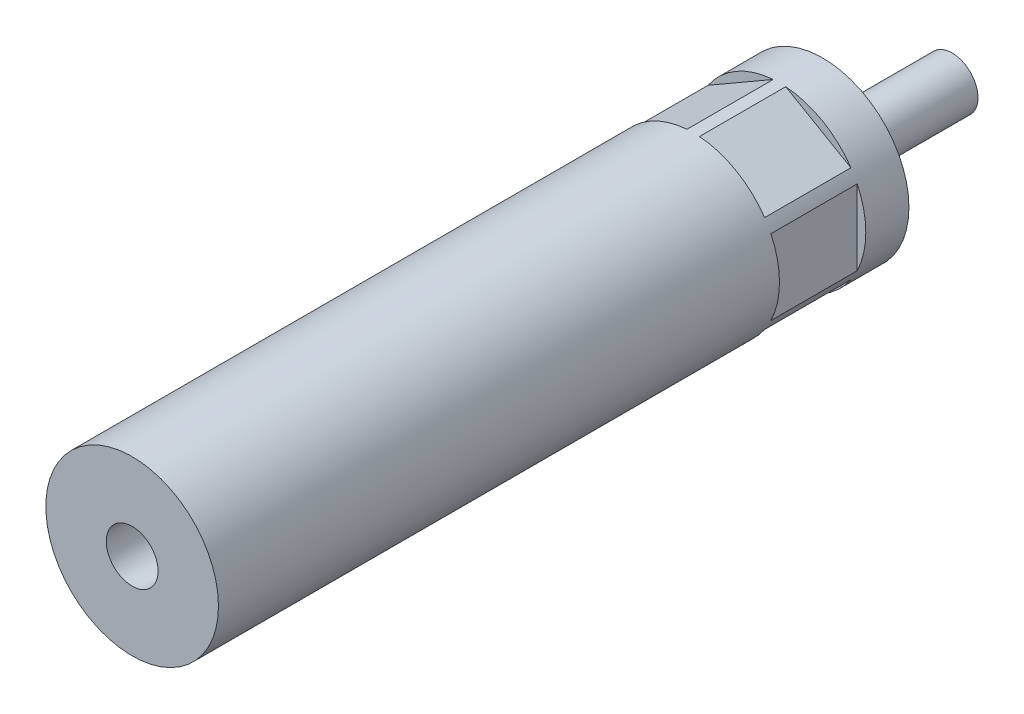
ISO-10303-21;
HEADER;
FILE_DESCRIPTION(('STEP AP214'),'2;1');
FILE_NAME('part.step','',(''),(''),'','','');
FILE_SCHEMA(('AUTOMOTIVE_DESIGN { 1 0 10303 214 1 1 1 1 }'));
ENDSEC;
DATA;
#1=APPLICATION_CONTEXT('core data for automotive mechanical design processes');
#2=APPLICATION_PROTOCOL_DEFINITION('international standard','automotive_design',2000,#1);
#3=PRODUCT_CONTEXT('',#1,'mechanical');
#4=PRODUCT('Part','Part','',(#3));
#5=PRODUCT_RELATED_PRODUCT_CATEGORY('part','',(#4));
#6=PRODUCT_DEFINITION_FORMATION('','',#4);
#7=PRODUCT_DEFINITION_CONTEXT('part definition',#1,'design');
#8=PRODUCT_DEFINITION('design','',#6,#7);
#9=PRODUCT_DEFINITION_SHAPE('','',#8);
#10=(LENGTH_UNIT() NAMED_UNIT(*) SI_UNIT(.MILLI.,.METRE.));
#11=(NAMED_UNIT(*) PLANE_ANGLE_UNIT() SI_UNIT($,.RADIAN.));
#12=(NAMED_UNIT(*) SI_UNIT($,.STERADIAN.) SOLID_ANGLE_UNIT());
#13=UNCERTAINTY_MEASURE_WITH_UNIT(LENGTH_MEASURE(1.E-05),#10,'distance_accuracy_value','');
#14=(GEOMETRIC_REPRESENTATION_CONTEXT(3) GLOBAL_UNCERTAINTY_ASSIGNED_CONTEXT((#13)) GLOBAL_UNIT_ASSIGNED_CONTEXT((#10,
#11,#12)) REPRESENTATION_CONTEXT('',''));
#15=CARTESIAN_POINT('',(0.,0.,0.));
#16=DIRECTION('',(0.,0.,1.));
#17=DIRECTION('',(1.,0.,0.));
#18=AXIS2_PLACEMENT_3D('',#15,#16,#17);
#19=CARTESIAN_POINT('',(0.,0.,80.));
#20=DIRECTION('',(0.,0.,1.));
#21=DIRECTION('',(1.,0.,0.));
#22=AXIS2_PLACEMENT_3D('',#19,#20,#21);
#23=CYLINDRICAL_SURFACE('',#22,20.);
#24=CARTESIAN_POINT('',(0.,0.,10.));
#25=DIRECTION('',(0.,0.,1.));
#26=DIRECTION('',(1.,0.,0.));
#27=AXIS2_PLACEMENT_3D('',#24,#25,#26);
#28=CIRCLE('',#27,20.);
#29=CARTESIAN_POINT('',(-16.5498344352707,-11.2295583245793,10.));
#30=VERTEX_POINT('',#29);
#31=CARTESIAN_POINT('',(-1.45016556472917,-19.9473562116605,10.));
#32=VERTEX_POINT('',#31);
#33=EDGE_CURVE('E152',#30,#32,#28,.T.);
#34=ORIENTED_EDGE('',*,*,#33,.F.);
#35=DIRECTION('',(0.,0.,1.));
#36=VECTOR('',#35,1.);
#37=CARTESIAN_POINT('',(-16.5498344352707,-11.2295583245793,80.));
#38=LINE('',#37,#36);
#39=CARTESIAN_POINT('',(-16.5498344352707,-11.2295583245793,30.));
#40=VERTEX_POINT('',#39);
#41=EDGE_CURVE('E9',#30,#40,#38,.T.);
#42=ORIENTED_EDGE('',*,*,#41,.T.);
#43=CARTESIAN_POINT('',(0.,0.,30.));
#44=DIRECTION('',(0.,0.,1.));
#45=DIRECTION('',(1.,0.,0.));
#46=AXIS2_PLACEMENT_3D('',#43,#44,#45);
#47=CIRCLE('',#46,20.);
#48=CARTESIAN_POINT('',(-1.45016556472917,-19.9473562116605,30.));
#49=VERTEX_POINT('',#48);
#50=EDGE_CURVE('E22',#40,#49,#47,.T.);
#51=ORIENTED_EDGE('',*,*,#50,.T.);
#52=DIRECTION('',(0.,0.,1.));
#53=VECTOR('',#52,1.);
#54=CARTESIAN_POINT('',(-1.45016556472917,-19.9473562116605,80.));
#55=LINE('',#54,#53);
#56=EDGE_CURVE('E149',#49,#32,#55,.F.);
#57=ORIENTED_EDGE('',*,*,#56,.T.);
#58=EDGE_LOOP('',(#34,#42,#51,#57));
#59=FACE_BOUND('',#58,.T.);
#60=DIRECTION('',(0.,0.,1.));
#61=VECTOR('',#60,1.);
#62=CARTESIAN_POINT('',(18.,8.71779788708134,80.));
#63=LINE('',#62,#61);
#64=CARTESIAN_POINT('',(18.,8.71779788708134,10.));
#65=VERTEX_POINT('',#64);
#66=CARTESIAN_POINT('',(18.,8.71779788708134,30.));
#67=VERTEX_POINT('',#66);
#68=EDGE_CURVE('E142',#65,#67,#63,.T.);
#69=ORIENTED_EDGE('',*,*,#68,.F.);
#70=CARTESIAN_POINT('',(18.,-8.71779788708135,10.));
#71=VERTEX_POINT('',#70);
#72=EDGE_CURVE('E141',#71,#65,#28,.T.);
#73=ORIENTED_EDGE('',*,*,#72,.F.);
#74=DIRECTION('',(0.,0.,1.));
#75=VECTOR('',#74,1.);
#76=CARTESIAN_POINT('',(18.,-8.71779788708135,80.));
#77=LINE('',#76,#75);
#78=CARTESIAN_POINT('',(18.,-8.71779788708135,30.));
#79=VERTEX_POINT('',#78);
#80=EDGE_CURVE('E138',#79,#71,#77,.F.);
#81=ORIENTED_EDGE('',*,*,#80,.F.);
#82=EDGE_CURVE('E145',#79,#67,#47,.T.);
#83=ORIENTED_EDGE('',*,*,#82,.T.);
#84=EDGE_LOOP('',(#69,#73,#81,#83));
#85=FACE_BOUND('',#84,.T.);
#86=CARTESIAN_POINT('',(16.5498344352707,11.2295583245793,10.));
#87=VERTEX_POINT('',#86);
#88=CARTESIAN_POINT('',(1.45016556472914,19.9473562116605,10.));
#89=VERTEX_POINT('',#88);
#90=EDGE_CURVE('E134',#87,#89,#28,.T.);
#91=ORIENTED_EDGE('',*,*,#90,.F.);
#92=DIRECTION('',(0.,0.,1.));
#93=VECTOR('',#92,1.);
#94=CARTESIAN_POINT('',(16.5498344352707,11.2295583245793,80.));
#95=LINE('',#94,#93);
#96=CARTESIAN_POINT('',(16.5498344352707,11.2295583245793,30.));
#97=VERTEX_POINT('',#96);
#98=EDGE_CURVE('E135',#87,#97,#95,.T.);
#99=ORIENTED_EDGE('',*,*,#98,.T.);
#100=CARTESIAN_POINT('',(1.45016556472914,19.9473562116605,30.));
#101=VERTEX_POINT('',#100);
#102=EDGE_CURVE('E139',#97,#101,#47,.T.);
#103=ORIENTED_EDGE('',*,*,#102,.T.);
#104=DIRECTION('',(0.,0.,1.));
#105=VECTOR('',#104,1.);
#106=CARTESIAN_POINT('',(1.45016556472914,19.9473562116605,80.));
#107=LINE('',#106,#105);
#108=EDGE_CURVE('E131',#101,#89,#107,.F.);
#109=ORIENTED_EDGE('',*,*,#108,.T.);
#110=EDGE_LOOP('',(#91,#99,#103,#109));
#111=FACE_BOUND('',#110,.T.);
#112=CARTESIAN_POINT('',(0.,0.,0.));
#113=DIRECTION('',(0.,0.,1.));
#114=DIRECTION('',(1.,0.,0.));
#115=AXIS2_PLACEMENT_3D('',#112,#113,#114);
#116=CIRCLE('',#115,20.);
#117=CARTESIAN_POINT('',(20.,0.,0.));
#118=VERTEX_POINT('',#117);
#119=EDGE_CURVE('E204',#118,#118,#116,.T.);
#120=ORIENTED_EDGE('',*,*,#119,.T.);
#121=EDGE_LOOP('',(#120));
#122=FACE_BOUND('',#121,.T.);
#123=CARTESIAN_POINT('',(0.,0.,160.));
#124=DIRECTION('',(0.,0.,1.));
#125=DIRECTION('',(1.,0.,0.));
#126=AXIS2_PLACEMENT_3D('',#123,#124,#125);
#127=CIRCLE('',#126,20.);
#128=CARTESIAN_POINT('',(20.,0.,160.));
#129=VERTEX_POINT('',#128);
#130=EDGE_CURVE('E201',#129,#129,#127,.T.);
#131=ORIENTED_EDGE('',*,*,#130,.F.);
#132=EDGE_LOOP('',(#131));
#133=FACE_BOUND('',#132,.T.);
#134=CARTESIAN_POINT('',(-18.,8.71779788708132,10.));
#135=VERTEX_POINT('',#134);
#136=CARTESIAN_POINT('',(-18.,-8.71779788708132,10.));
#137=VERTEX_POINT('',#136);
#138=EDGE_CURVE('E111',#135,#137,#28,.T.);
#139=ORIENTED_EDGE('',*,*,#138,.F.);
#140=DIRECTION('',(0.,0.,1.));
#141=VECTOR('',#140,1.);
#142=CARTESIAN_POINT('',(-18.,8.71779788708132,80.));
#143=LINE('',#142,#141);
#144=CARTESIAN_POINT('',(-18.,8.71779788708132,30.));
#145=VERTEX_POINT('',#144);
#146=EDGE_CURVE('E110',#135,#145,#143,.T.);
#147=ORIENTED_EDGE('',*,*,#146,.T.);
#148=CARTESIAN_POINT('',(-18.,-8.71779788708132,30.));
#149=VERTEX_POINT('',#148);
#150=EDGE_CURVE('E103',#145,#149,#47,.T.);
#151=ORIENTED_EDGE('',*,*,#150,.T.);
#152=DIRECTION('',(0.,0.,1.));
#153=VECTOR('',#152,1.);
#154=CARTESIAN_POINT('',(-18.,-8.71779788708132,80.));
#155=LINE('',#154,#153);
#156=EDGE_CURVE('E117',#149,#137,#155,.F.);
#157=ORIENTED_EDGE('',*,*,#156,.T.);
#158=EDGE_LOOP('',(#139,#147,#151,#157));
#159=FACE_BOUND('',#158,.T.);
#160=DIRECTION('',(0.,0.,1.));
#161=VECTOR('',#160,1.);
#162=CARTESIAN_POINT('',(-16.5498344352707,11.2295583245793,80.));
#163=LINE('',#162,#161);
#164=CARTESIAN_POINT('',(-16.5498344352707,11.2295583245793,10.));
#165=VERTEX_POINT('',#164);
#166=CARTESIAN_POINT('',(-16.5498344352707,11.2295583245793,30.));
#167=VERTEX_POINT('',#166);
#168=EDGE_CURVE('E129',#165,#167,#163,.T.);
#169=ORIENTED_EDGE('',*,*,#168,.F.);
#170=CARTESIAN_POINT('',(-1.45016556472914,19.9473562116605,10.));
#171=VERTEX_POINT('',#170);
#172=EDGE_CURVE('E125',#171,#165,#28,.T.);
#173=ORIENTED_EDGE('',*,*,#172,.F.);
#174=DIRECTION('',(0.,0.,1.));
#175=VECTOR('',#174,1.);
#176=CARTESIAN_POINT('',(-1.45016556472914,19.9473562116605,80.));
#177=LINE('',#176,#175);
#178=CARTESIAN_POINT('',(-1.45016556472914,19.9473562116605,30.));
#179=VERTEX_POINT('',#178);
#180=EDGE_CURVE('E123',#179,#171,#177,.F.);
#181=ORIENTED_EDGE('',*,*,#180,.F.);
#182=EDGE_CURVE('E113',#179,#167,#47,.T.);
#183=ORIENTED_EDGE('',*,*,#182,.T.);
#184=EDGE_LOOP('',(#169,#173,#181,#183));
#185=FACE_BOUND('',#184,.T.);
#186=DIRECTION('',(0.,0.,1.));
#187=VECTOR('',#186,1.);
#188=CARTESIAN_POINT('',(16.5498344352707,-11.2295583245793,80.));
#189=LINE('',#188,#187);
#190=CARTESIAN_POINT('',(16.5498344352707,-11.2295583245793,10.));
#191=VERTEX_POINT('',#190);
#192=CARTESIAN_POINT('',(16.5498344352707,-11.2295583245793,30.));
#193=VERTEX_POINT('',#192);
#194=EDGE_CURVE('E148',#191,#193,#189,.T.);
#195=ORIENTED_EDGE('',*,*,#194,.F.);
#196=CARTESIAN_POINT('',(1.45016556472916,-19.9473562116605,10.));
#197=VERTEX_POINT('',#196);
#198=EDGE_CURVE('E147',#197,#191,#28,.T.);
#199=ORIENTED_EDGE('',*,*,#198,.F.);
#200=DIRECTION('',(0.,0.,1.));
#201=VECTOR('',#200,1.);
#202=CARTESIAN_POINT('',(1.45016556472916,-19.9473562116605,80.));
#203=LINE('',#202,#201);
#204=CARTESIAN_POINT('',(1.45016556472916,-19.9473562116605,30.));
#205=VERTEX_POINT('',#204);
#206=EDGE_CURVE('E144',#205,#197,#203,.F.);
#207=ORIENTED_EDGE('',*,*,#206,.F.);
#208=EDGE_CURVE('E150',#205,#193,#47,.T.);
#209=ORIENTED_EDGE('',*,*,#208,.T.);
#210=EDGE_LOOP('',(#195,#199,#207,#209));
#211=FACE_BOUND('',#210,.T.);
#212=ADVANCED_FACE('F14',(#59,#85,#111,#122,#133,#159,#185,#211),#23,.T.);
#213=CARTESIAN_POINT('',(0.,0.,-30.));
#214=DIRECTION('',(0.,0.,1.));
#215=DIRECTION('',(1.,0.,0.));
#216=AXIS2_PLACEMENT_3D('',#213,#214,#215);
#217=PLANE('',#216);
#218=CARTESIAN_POINT('',(0.,0.,-30.));
#219=DIRECTION('',(0.,0.,1.));
#220=DIRECTION('',(1.,0.,0.));
#221=AXIS2_PLACEMENT_3D('',#218,#219,#220);
#222=CIRCLE('',#221,6.);
#223=CARTESIAN_POINT('',(6.,0.,-30.));
#224=VERTEX_POINT('',#223);
#225=EDGE_CURVE('E159',#224,#224,#222,.T.);
#226=ORIENTED_EDGE('',*,*,#225,.F.);
#227=EDGE_LOOP('',(#226));
#228=FACE_BOUND('',#227,.T.);
#229=ADVANCED_FACE('F16',(#228),#217,.F.);
#230=CARTESIAN_POINT('',(0.,0.,80.));
#231=DIRECTION('',(0.,0.,1.));
#232=DIRECTION('',(1.,0.,0.));
#233=AXIS2_PLACEMENT_3D('',#230,#231,#232);
#234=CYLINDRICAL_SURFACE('',#233,6.);
#235=CARTESIAN_POINT('',(0.,0.,-3.5));
#236=DIRECTION('',(0.,0.,1.));
#237=DIRECTION('',(1.,0.,0.));
#238=AXIS2_PLACEMENT_3D('',#235,#236,#237);
#239=CIRCLE('',#238,6.);
#240=CARTESIAN_POINT('',(6.,0.,-3.5));
#241=VERTEX_POINT('',#240);
#242=EDGE_CURVE('E213',#241,#241,#239,.T.);
#243=ORIENTED_EDGE('',*,*,#242,.F.);
#244=EDGE_LOOP('',(#243));
#245=FACE_BOUND('',#244,.T.);
#246=ORIENTED_EDGE('',*,*,#225,.T.);
#247=EDGE_LOOP('',(#246));
#248=FACE_BOUND('',#247,.T.);
#249=ADVANCED_FACE('F219',(#245,#248),#234,.T.);
#250=CARTESIAN_POINT('',(4.7,0.,-3.5));
#251=DIRECTION('',(0.,0.,1.));
#252=DIRECTION('',(1.,0.,0.));
#253=AXIS2_PLACEMENT_3D('',#250,#251,#252);
#254=PLANE('',#253);
#255=ORIENTED_EDGE('',*,*,#242,.T.);
#256=EDGE_LOOP('',(#255));
#257=FACE_BOUND('',#256,.T.);
#258=CARTESIAN_POINT('',(0.,0.,-3.5));
#259=DIRECTION('',(0.,0.,1.));
#260=DIRECTION('',(1.,0.,0.));
#261=AXIS2_PLACEMENT_3D('',#258,#259,#260);
#262=CIRCLE('',#261,4.7);
#263=CARTESIAN_POINT('',(4.7,0.,-3.5));
#264=VERTEX_POINT('',#263);
#265=EDGE_CURVE('E210',#264,#264,#262,.T.);
#266=ORIENTED_EDGE('',*,*,#265,.F.);
#267=EDGE_LOOP('',(#266));
#268=FACE_BOUND('',#267,.T.);
#269=ADVANCED_FACE('F228',(#257,#268),#254,.T.);
#270=CARTESIAN_POINT('',(0.,0.,80.));
#271=DIRECTION('',(0.,0.,1.));
#272=DIRECTION('',(1.,0.,0.));
#273=AXIS2_PLACEMENT_3D('',#270,#271,#272);
#274=CYLINDRICAL_SURFACE('',#273,4.7);
#275=ORIENTED_EDGE('',*,*,#265,.T.);
#276=EDGE_LOOP('',(#275));
#277=FACE_BOUND('',#276,.T.);
#278=CARTESIAN_POINT('',(0.,0.,0.));
#279=DIRECTION('',(0.,0.,1.));
#280=DIRECTION('',(1.,0.,0.));
#281=AXIS2_PLACEMENT_3D('',#278,#279,#280);
#282=CIRCLE('',#281,4.7);
#283=CARTESIAN_POINT('',(4.7,0.,0.));
#284=VERTEX_POINT('',#283);
#285=EDGE_CURVE('E207',#284,#284,#282,.T.);
#286=ORIENTED_EDGE('',*,*,#285,.F.);
#287=EDGE_LOOP('',(#286));
#288=FACE_BOUND('',#287,.T.);
#289=ADVANCED_FACE('F241',(#277,#288),#274,.T.);
#290=CARTESIAN_POINT('',(20.,0.,0.));
#291=DIRECTION('',(0.,0.,-1.));
#292=DIRECTION('',(-1.,0.,0.));
#293=AXIS2_PLACEMENT_3D('',#290,#291,#292);
#294=PLANE('',#293);
#295=ORIENTED_EDGE('',*,*,#285,.T.);
#296=EDGE_LOOP('',(#295));
#297=FACE_BOUND('',#296,.T.);
#298=ORIENTED_EDGE('',*,*,#119,.F.);
#299=EDGE_LOOP('',(#298));
#300=FACE_BOUND('',#299,.T.);
#301=ADVANCED_FACE('F238',(#297,#300),#294,.T.);
#302=CARTESIAN_POINT('',(20.,0.,160.));
#303=DIRECTION('',(0.,0.,-1.));
#304=DIRECTION('',(-1.,0.,0.));
#305=AXIS2_PLACEMENT_3D('',#302,#303,#304);
#306=PLANE('',#305);
#307=CARTESIAN_POINT('',(0.,0.,160.));
#308=DIRECTION('',(0.,0.,1.));
#309=DIRECTION('',(1.,0.,0.));
#310=AXIS2_PLACEMENT_3D('',#307,#308,#309);
#311=CIRCLE('',#310,6.);
#312=CARTESIAN_POINT('',(6.,0.,160.));
#313=VERTEX_POINT('',#312);
#314=EDGE_CURVE('E190',#313,#313,#311,.T.);
#315=ORIENTED_EDGE('',*,*,#314,.F.);
#316=EDGE_LOOP('',(#315));
#317=FACE_BOUND('',#316,.T.);
#318=ORIENTED_EDGE('',*,*,#130,.T.);
#319=EDGE_LOOP('',(#318));
#320=FACE_BOUND('',#319,.T.);
#321=ADVANCED_FACE('F236',(#317,#320),#306,.F.);
#322=CARTESIAN_POINT('',(0.,0.,80.));
#323=DIRECTION('',(0.,0.,1.));
#324=DIRECTION('',(1.,0.,0.));
#325=AXIS2_PLACEMENT_3D('',#322,#323,#324);
#326=CYLINDRICAL_SURFACE('',#325,6.);
#327=CARTESIAN_POINT('',(0.,0.,125.));
#328=DIRECTION('',(0.,0.,1.));
#329=DIRECTION('',(1.,0.,0.));
#330=AXIS2_PLACEMENT_3D('',#327,#328,#329);
#331=CIRCLE('',#330,6.);
#332=CARTESIAN_POINT('',(6.,0.,125.));
#333=VERTEX_POINT('',#332);
#334=EDGE_CURVE('E318',#333,#333,#331,.T.);
#335=ORIENTED_EDGE('',*,*,#334,.F.);
#336=EDGE_LOOP('',(#335));
#337=FACE_BOUND('',#336,.T.);
#338=ORIENTED_EDGE('',*,*,#314,.T.);
#339=EDGE_LOOP('',(#338));
#340=FACE_BOUND('',#339,.T.);
#341=ADVANCED_FACE('F263',(#337,#340),#326,.F.);
#342=CARTESIAN_POINT('',(-18.,10.3923048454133,30.));
#343=DIRECTION('',(1.,0.,0.));
#344=DIRECTION('',(0.,1.,0.));
#345=AXIS2_PLACEMENT_3D('',#342,#343,#344);
#346=PLANE('',#345);
#347=DIRECTION('',(0.,-1.,0.));
#348=VECTOR('',#347,1.);
#349=CARTESIAN_POINT('',(-18.,10.3923048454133,10.));
#350=LINE('',#349,#348);
#351=EDGE_CURVE('E319',#135,#137,#350,.T.);
#352=ORIENTED_EDGE('',*,*,#351,.T.);
#353=ORIENTED_EDGE('',*,*,#156,.F.);
#354=DIRECTION('',(0.,-1.,0.));
#355=VECTOR('',#354,1.);
#356=CARTESIAN_POINT('',(-18.,10.3923048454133,30.));
#357=LINE('',#356,#355);
#358=EDGE_CURVE('E106',#145,#149,#357,.T.);
#359=ORIENTED_EDGE('',*,*,#358,.F.);
#360=ORIENTED_EDGE('',*,*,#146,.F.);
#361=EDGE_LOOP('',(#352,#353,#359,#360));
#362=FACE_BOUND('',#361,.T.);
#363=ADVANCED_FACE('F115',(#362),#346,.F.);
#364=CARTESIAN_POINT('',(0.,0.,10.));
#365=DIRECTION('',(0.,0.,1.));
#366=DIRECTION('',(1.,0.,0.));
#367=AXIS2_PLACEMENT_3D('',#364,#365,#366);
#368=PLANE('',#367);
#369=ORIENTED_EDGE('',*,*,#138,.T.);
#370=ORIENTED_EDGE('',*,*,#351,.F.);
#371=EDGE_LOOP('',(#369,#370));
#372=FACE_BOUND('',#371,.T.);
#373=ADVANCED_FACE('F276',(#372),#368,.T.);
#374=CARTESIAN_POINT('',(0.,0.,30.));
#375=DIRECTION('',(0.,0.,1.));
#376=DIRECTION('',(1.,0.,0.));
#377=AXIS2_PLACEMENT_3D('',#374,#375,#376);
#378=PLANE('',#377);
#379=ORIENTED_EDGE('',*,*,#358,.T.);
#380=ORIENTED_EDGE('',*,*,#150,.F.);
#381=EDGE_LOOP('',(#379,#380));
#382=FACE_BOUND('',#381,.T.);
#383=ADVANCED_FACE('F105',(#382),#378,.F.);
#384=CARTESIAN_POINT('',(-18.,10.3923048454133,30.));
#385=DIRECTION('',(-0.5,0.866025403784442,0.));
#386=DIRECTION('',(-0.866025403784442,-0.5,0.));
#387=AXIS2_PLACEMENT_3D('',#384,#385,#386);
#388=PLANE('',#387);
#389=ORIENTED_EDGE('',*,*,#168,.T.);
#390=DIRECTION('',(0.866025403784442,0.5,0.));
#391=VECTOR('',#390,1.);
#392=CARTESIAN_POINT('',(-18.,10.3923048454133,30.));
#393=LINE('',#392,#391);
#394=EDGE_CURVE('E118',#167,#179,#393,.T.);
#395=ORIENTED_EDGE('',*,*,#394,.T.);
#396=ORIENTED_EDGE('',*,*,#180,.T.);
#397=DIRECTION('',(0.866025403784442,0.5,0.));
#398=VECTOR('',#397,1.);
#399=CARTESIAN_POINT('',(-18.,10.3923048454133,10.));
#400=LINE('',#399,#398);
#401=EDGE_CURVE('E321',#165,#171,#400,.T.);
#402=ORIENTED_EDGE('',*,*,#401,.F.);
#403=EDGE_LOOP('',(#389,#395,#396,#402));
#404=FACE_BOUND('',#403,.T.);
#405=ADVANCED_FACE('F303',(#404),#388,.T.);
#406=ORIENTED_EDGE('',*,*,#172,.T.);
#407=ORIENTED_EDGE('',*,*,#401,.T.);
#408=EDGE_LOOP('',(#406,#407));
#409=FACE_BOUND('',#408,.T.);
#410=ADVANCED_FACE('F291',(#409),#368,.T.);
#411=ORIENTED_EDGE('',*,*,#394,.F.);
#412=ORIENTED_EDGE('',*,*,#182,.F.);
#413=EDGE_LOOP('',(#411,#412));
#414=FACE_BOUND('',#413,.T.);
#415=ADVANCED_FACE('F286',(#414),#378,.F.);
#416=CARTESIAN_POINT('',(18.,10.3923048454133,30.));
#417=DIRECTION('',(-0.499999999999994,-0.866025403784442,0.));
#418=DIRECTION('',(0.866025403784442,-0.499999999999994,0.));
#419=AXIS2_PLACEMENT_3D('',#416,#417,#418);
#420=PLANE('',#419);
#421=DIRECTION('',(-0.866025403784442,0.499999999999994,0.));
#422=VECTOR('',#421,1.);
#423=CARTESIAN_POINT('',(18.,10.3923048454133,10.));
#424=LINE('',#423,#422);
#425=EDGE_CURVE('E329',#87,#89,#424,.T.);
#426=ORIENTED_EDGE('',*,*,#425,.T.);
#427=ORIENTED_EDGE('',*,*,#108,.F.);
#428=DIRECTION('',(-0.866025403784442,0.499999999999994,0.));
#429=VECTOR('',#428,1.);
#430=CARTESIAN_POINT('',(18.,10.3923048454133,30.));
#431=LINE('',#430,#429);
#432=EDGE_CURVE('E192',#97,#101,#431,.T.);
#433=ORIENTED_EDGE('',*,*,#432,.F.);
#434=ORIENTED_EDGE('',*,*,#98,.F.);
#435=EDGE_LOOP('',(#426,#427,#433,#434));
#436=FACE_BOUND('',#435,.T.);
#437=ADVANCED_FACE('F290',(#436),#420,.F.);
#438=ORIENTED_EDGE('',*,*,#90,.T.);
#439=ORIENTED_EDGE('',*,*,#425,.F.);
#440=EDGE_LOOP('',(#438,#439));
#441=FACE_BOUND('',#440,.T.);
#442=ADVANCED_FACE('F284',(#441),#368,.T.);
#443=ORIENTED_EDGE('',*,*,#432,.T.);
#444=ORIENTED_EDGE('',*,*,#102,.F.);
#445=EDGE_LOOP('',(#443,#444));
#446=FACE_BOUND('',#445,.T.);
#447=ADVANCED_FACE('F280',(#446),#378,.F.);
#448=CARTESIAN_POINT('',(18.,10.3923048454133,30.));
#449=DIRECTION('',(1.,0.,0.));
#450=DIRECTION('',(0.,1.,0.));
#451=AXIS2_PLACEMENT_3D('',#448,#449,#450);
#452=PLANE('',#451);
#453=ORIENTED_EDGE('',*,*,#68,.T.);
#454=DIRECTION('',(0.,-1.,0.));
#455=VECTOR('',#454,1.);
#456=CARTESIAN_POINT('',(18.,10.3923048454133,30.));
#457=LINE('',#456,#455);
#458=EDGE_CURVE('E187',#67,#79,#457,.T.);
#459=ORIENTED_EDGE('',*,*,#458,.T.);
#460=ORIENTED_EDGE('',*,*,#80,.T.);
#461=DIRECTION('',(0.,-1.,0.));
#462=VECTOR('',#461,1.);
#463=CARTESIAN_POINT('',(18.,10.3923048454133,10.));
#464=LINE('',#463,#462);
#465=EDGE_CURVE('E328',#65,#71,#464,.T.);
#466=ORIENTED_EDGE('',*,*,#465,.F.);
#467=EDGE_LOOP('',(#453,#459,#460,#466));
#468=FACE_BOUND('',#467,.T.);
#469=ADVANCED_FACE('F283',(#468),#452,.T.);
#470=ORIENTED_EDGE('',*,*,#72,.T.);
#471=ORIENTED_EDGE('',*,*,#465,.T.);
#472=EDGE_LOOP('',(#470,#471));
#473=FACE_BOUND('',#472,.T.);
#474=ADVANCED_FACE('F292',(#473),#368,.T.);
#475=ORIENTED_EDGE('',*,*,#458,.F.);
#476=ORIENTED_EDGE('',*,*,#82,.F.);
#477=EDGE_LOOP('',(#475,#476));
#478=FACE_BOUND('',#477,.T.);
#479=ADVANCED_FACE('F287',(#478),#378,.F.);
#480=CARTESIAN_POINT('',(18.,-10.3923048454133,30.));
#481=DIRECTION('',(0.5,-0.866025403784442,0.));
#482=DIRECTION('',(0.866025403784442,0.5,0.));
#483=AXIS2_PLACEMENT_3D('',#480,#481,#482);
#484=PLANE('',#483);
#485=ORIENTED_EDGE('',*,*,#194,.T.);
#486=DIRECTION('',(-0.866025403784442,-0.5,0.));
#487=VECTOR('',#486,1.);
#488=CARTESIAN_POINT('',(18.,-10.3923048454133,30.));
#489=LINE('',#488,#487);
#490=EDGE_CURVE('E37',#193,#205,#489,.T.);
#491=ORIENTED_EDGE('',*,*,#490,.T.);
#492=ORIENTED_EDGE('',*,*,#206,.T.);
#493=DIRECTION('',(-0.866025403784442,-0.5,0.));
#494=VECTOR('',#493,1.);
#495=CARTESIAN_POINT('',(18.,-10.3923048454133,10.));
#496=LINE('',#495,#494);
#497=EDGE_CURVE('E325',#191,#197,#496,.T.);
#498=ORIENTED_EDGE('',*,*,#497,.F.);
#499=EDGE_LOOP('',(#485,#491,#492,#498));
#500=FACE_BOUND('',#499,.T.);
#501=ADVANCED_FACE('F293',(#500),#484,.T.);
#502=ORIENTED_EDGE('',*,*,#198,.T.);
#503=ORIENTED_EDGE('',*,*,#497,.T.);
#504=EDGE_LOOP('',(#502,#503));
#505=FACE_BOUND('',#504,.T.);
#506=ADVANCED_FACE('F296',(#505),#368,.T.);
#507=ORIENTED_EDGE('',*,*,#490,.F.);
#508=ORIENTED_EDGE('',*,*,#208,.F.);
#509=EDGE_LOOP('',(#507,#508));
#510=FACE_BOUND('',#509,.T.);
#511=ADVANCED_FACE('F185',(#510),#378,.F.);
#512=DIRECTION('',(0.866025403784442,-0.5,0.));
#513=VECTOR('',#512,1.);
#514=CARTESIAN_POINT('',(-18.,-10.3923048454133,30.));
#515=LINE('',#514,#513);
#516=EDGE_CURVE('E186',#40,#49,#515,.T.);
#517=ORIENTED_EDGE('',*,*,#516,.T.);
#518=ORIENTED_EDGE('',*,*,#50,.F.);
#519=EDGE_LOOP('',(#517,#518));
#520=FACE_BOUND('',#519,.T.);
#521=ADVANCED_FACE('F342',(#520),#378,.F.);
#522=ORIENTED_EDGE('',*,*,#33,.T.);
#523=DIRECTION('',(0.866025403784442,-0.5,0.));
#524=VECTOR('',#523,1.);
#525=CARTESIAN_POINT('',(-18.,-10.3923048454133,10.));
#526=LINE('',#525,#524);
#527=EDGE_CURVE('E29',#30,#32,#526,.T.);
#528=ORIENTED_EDGE('',*,*,#527,.F.);
#529=EDGE_LOOP('',(#522,#528));
#530=FACE_BOUND('',#529,.T.);
#531=ADVANCED_FACE('F311',(#530),#368,.T.);
#532=CARTESIAN_POINT('',(-18.,-10.3923048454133,30.));
#533=DIRECTION('',(0.5,0.866025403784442,0.));
#534=DIRECTION('',(-0.866025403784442,0.5,0.));
#535=AXIS2_PLACEMENT_3D('',#532,#533,#534);
#536=PLANE('',#535);
#537=ORIENTED_EDGE('',*,*,#527,.T.);
#538=ORIENTED_EDGE('',*,*,#56,.F.);
#539=ORIENTED_EDGE('',*,*,#516,.F.);
#540=ORIENTED_EDGE('',*,*,#41,.F.);
#541=EDGE_LOOP('',(#537,#538,#539,#540));
#542=FACE_BOUND('',#541,.T.);
#543=ADVANCED_FACE('F307',(#542),#536,.F.);
#544=CARTESIAN_POINT('',(0.,0.,125.));
#545=DIRECTION('',(0.,0.,1.));
#546=DIRECTION('',(1.,0.,0.));
#547=AXIS2_PLACEMENT_3D('',#544,#545,#546);
#548=PLANE('',#547);
#549=ORIENTED_EDGE('',*,*,#334,.T.);
#550=EDGE_LOOP('',(#549));
#551=FACE_BOUND('',#550,.T.);
#552=ADVANCED_FACE('F310',(#551),#548,.T.);
#553=CLOSED_SHELL('',(#212,#229,#249,#269,#289,#301,#321,#341,#363,#373,#383,#405,#410,#415,
#437,#442,#447,#469,#474,#479,#501,#506,#511,#521,#531,#543,#552));
#554=MANIFOLD_SOLID_BREP('B1',#553);
#555=ADVANCED_BREP_SHAPE_REPRESENTATION('',(#18,#554),#14);
#556=SHAPE_DEFINITION_REPRESENTATION(#9,#555);
ENDSEC;
END-ISO-10303-21;
